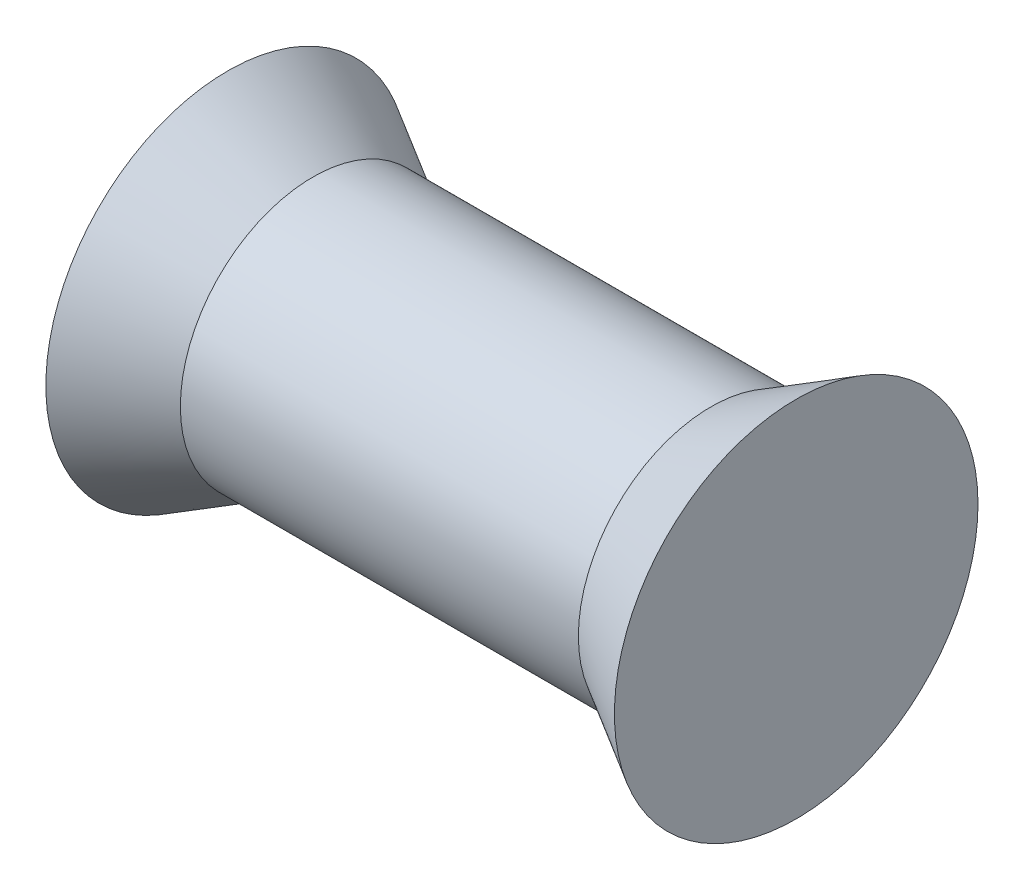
ISO-10303-21;
HEADER;
FILE_DESCRIPTION(('STEP AP214'),'2;1');
FILE_NAME('part.step','',(''),(''),'','','');
FILE_SCHEMA(('AUTOMOTIVE_DESIGN { 1 0 10303 214 1 1 1 1 }'));
ENDSEC;
DATA;
#1=APPLICATION_CONTEXT('core data for automotive mechanical design processes');
#2=APPLICATION_PROTOCOL_DEFINITION('international standard','automotive_design',2000,#1);
#3=PRODUCT_CONTEXT('',#1,'mechanical');
#4=PRODUCT('Part','Part','',(#3));
#5=PRODUCT_RELATED_PRODUCT_CATEGORY('part','',(#4));
#6=PRODUCT_DEFINITION_FORMATION('','',#4);
#7=PRODUCT_DEFINITION_CONTEXT('part definition',#1,'design');
#8=PRODUCT_DEFINITION('design','',#6,#7);
#9=PRODUCT_DEFINITION_SHAPE('','',#8);
#10=(LENGTH_UNIT() NAMED_UNIT(*) SI_UNIT(.MILLI.,.METRE.));
#11=(NAMED_UNIT(*) PLANE_ANGLE_UNIT() SI_UNIT($,.RADIAN.));
#12=(NAMED_UNIT(*) SI_UNIT($,.STERADIAN.) SOLID_ANGLE_UNIT());
#13=UNCERTAINTY_MEASURE_WITH_UNIT(LENGTH_MEASURE(1.E-05),#10,'distance_accuracy_value','');
#14=(GEOMETRIC_REPRESENTATION_CONTEXT(3) GLOBAL_UNCERTAINTY_ASSIGNED_CONTEXT((#13)) GLOBAL_UNIT_ASSIGNED_CONTEXT((#10,
#11,#12)) REPRESENTATION_CONTEXT('',''));
#15=CARTESIAN_POINT('',(0.,0.,0.));
#16=DIRECTION('',(0.,0.,1.));
#17=DIRECTION('',(1.,0.,0.));
#18=AXIS2_PLACEMENT_3D('',#15,#16,#17);
#19=CARTESIAN_POINT('',(0.,0.,0.));
#20=DIRECTION('',(1.,0.,0.));
#21=DIRECTION('',(0.,0.,-1.));
#22=AXIS2_PLACEMENT_3D('',#19,#20,#21);
#23=PLANE('',#22);
#24=CARTESIAN_POINT('',(0.,0.,0.));
#25=DIRECTION('',(1.,0.,0.));
#26=DIRECTION('',(0.,0.,-1.));
#27=AXIS2_PLACEMENT_3D('',#24,#25,#26);
#28=CIRCLE('',#27,3.24843181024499);
#29=CARTESIAN_POINT('',(0.,0.,-3.24843181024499));
#30=VERTEX_POINT('',#29);
#31=EDGE_CURVE('E10',#30,#30,#28,.T.);
#32=ORIENTED_EDGE('',*,*,#31,.T.);
#33=EDGE_LOOP('',(#32));
#34=FACE_BOUND('',#33,.T.);
#35=ADVANCED_FACE('F34',(#34),#23,.T.);
#36=CARTESIAN_POINT('',(0.,0.,0.));
#37=DIRECTION('',(1.,0.,0.));
#38=DIRECTION('',(0.,0.,-1.));
#39=AXIS2_PLACEMENT_3D('',#36,#37,#38);
#40=CONICAL_SURFACE('',#39,3.24843181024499,0.523598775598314);
#41=CARTESIAN_POINT('',(-1.524,0.,0.));
#42=DIRECTION('',(1.,0.,0.));
#43=DIRECTION('',(0.,0.,-1.));
#44=AXIS2_PLACEMENT_3D('',#41,#42,#43);
#45=CIRCLE('',#44,2.36854999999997);
#46=CARTESIAN_POINT('',(-1.524,0.,-2.36854999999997));
#47=VERTEX_POINT('',#46);
#48=EDGE_CURVE('E40',#47,#47,#45,.T.);
#49=ORIENTED_EDGE('',*,*,#48,.T.);
#50=EDGE_LOOP('',(#49));
#51=FACE_BOUND('',#50,.T.);
#52=ORIENTED_EDGE('',*,*,#31,.F.);
#53=EDGE_LOOP('',(#52));
#54=FACE_BOUND('',#53,.T.);
#55=ADVANCED_FACE('F66',(#51,#54),#40,.T.);
#56=CARTESIAN_POINT('',(0.,0.,0.));
#57=DIRECTION('',(1.,0.,0.));
#58=DIRECTION('',(0.,0.,-1.));
#59=AXIS2_PLACEMENT_3D('',#56,#57,#58);
#60=CYLINDRICAL_SURFACE('',#59,2.36854999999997);
#61=CARTESIAN_POINT('',(-8.636,0.,0.));
#62=DIRECTION('',(1.,0.,0.));
#63=DIRECTION('',(0.,0.,-1.));
#64=AXIS2_PLACEMENT_3D('',#61,#62,#63);
#65=CIRCLE('',#64,2.36854999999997);
#66=CARTESIAN_POINT('',(-8.636,0.,-2.36854999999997));
#67=VERTEX_POINT('',#66);
#68=EDGE_CURVE('E44',#67,#67,#65,.T.);
#69=ORIENTED_EDGE('',*,*,#68,.T.);
#70=EDGE_LOOP('',(#69));
#71=FACE_BOUND('',#70,.T.);
#72=ORIENTED_EDGE('',*,*,#48,.F.);
#73=EDGE_LOOP('',(#72));
#74=FACE_BOUND('',#73,.T.);
#75=ADVANCED_FACE('F63',(#71,#74),#60,.T.);
#76=CARTESIAN_POINT('',(-8.636,0.,0.));
#77=DIRECTION('',(-1.,0.,0.));
#78=DIRECTION('',(0.,0.,1.));
#79=AXIS2_PLACEMENT_3D('',#76,#77,#78);
#80=CONICAL_SURFACE('',#79,2.36854999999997,0.5235987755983);
#81=CARTESIAN_POINT('',(-10.16,0.,0.));
#82=DIRECTION('',(1.,0.,0.));
#83=DIRECTION('',(0.,0.,-1.));
#84=AXIS2_PLACEMENT_3D('',#81,#82,#83);
#85=CIRCLE('',#84,3.24843181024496);
#86=CARTESIAN_POINT('',(-10.16,0.,-3.24843181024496));
#87=VERTEX_POINT('',#86);
#88=EDGE_CURVE('E48',#87,#87,#85,.T.);
#89=ORIENTED_EDGE('',*,*,#88,.T.);
#90=EDGE_LOOP('',(#89));
#91=FACE_BOUND('',#90,.T.);
#92=ORIENTED_EDGE('',*,*,#68,.F.);
#93=EDGE_LOOP('',(#92));
#94=FACE_BOUND('',#93,.T.);
#95=ADVANCED_FACE('F54',(#91,#94),#80,.T.);
#96=CARTESIAN_POINT('',(-10.16,3.24843181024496,0.));
#97=DIRECTION('',(-1.,0.,0.));
#98=DIRECTION('',(0.,0.,1.));
#99=AXIS2_PLACEMENT_3D('',#96,#97,#98);
#100=PLANE('',#99);
#101=ORIENTED_EDGE('',*,*,#88,.F.);
#102=EDGE_LOOP('',(#101));
#103=FACE_BOUND('',#102,.T.);
#104=ADVANCED_FACE('F57',(#103),#100,.T.);
#105=CLOSED_SHELL('',(#35,#55,#75,#95,#104));
#106=MANIFOLD_SOLID_BREP('B2',#105);
#107=ADVANCED_BREP_SHAPE_REPRESENTATION('',(#18,#106),#14);
#108=SHAPE_DEFINITION_REPRESENTATION(#9,#107);
ENDSEC;
END-ISO-10303-21;
